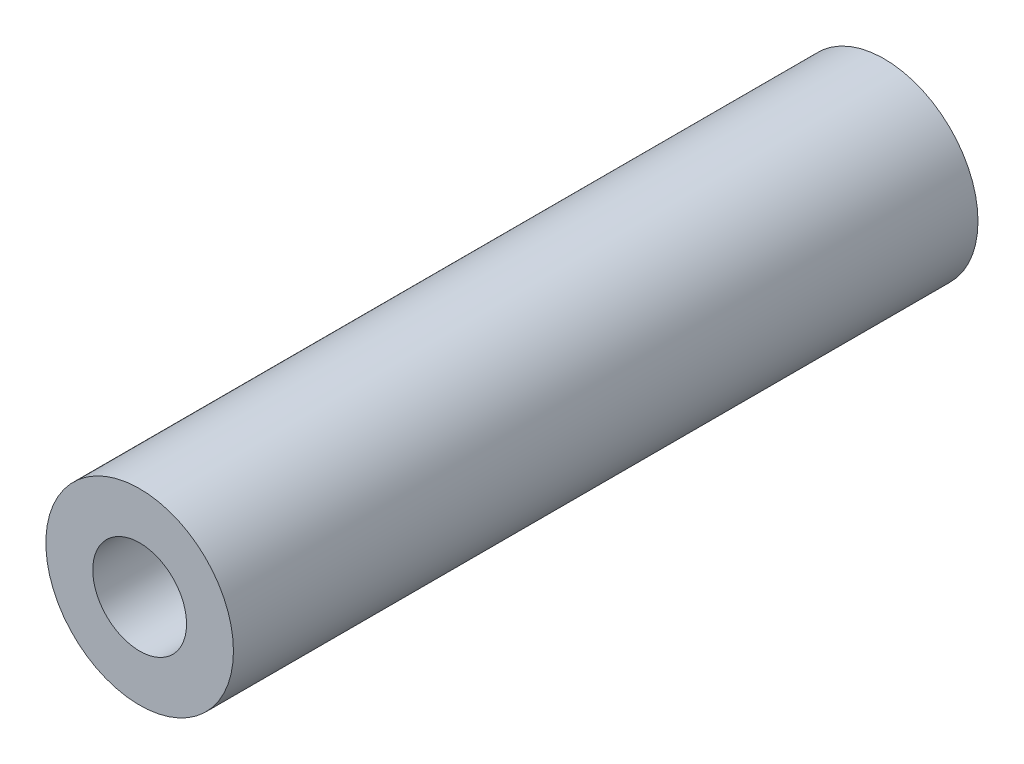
ISO-10303-21;
HEADER;
FILE_DESCRIPTION(('STEP AP214'),'2;1');
FILE_NAME('part.step','',(''),(''),'','','');
FILE_SCHEMA(('AUTOMOTIVE_DESIGN { 1 0 10303 214 1 1 1 1 }'));
ENDSEC;
DATA;
#1=APPLICATION_CONTEXT('core data for automotive mechanical design processes');
#2=APPLICATION_PROTOCOL_DEFINITION('international standard','automotive_design',2000,#1);
#3=PRODUCT_CONTEXT('',#1,'mechanical');
#4=PRODUCT('Part','Part','',(#3));
#5=PRODUCT_RELATED_PRODUCT_CATEGORY('part','',(#4));
#6=PRODUCT_DEFINITION_FORMATION('','',#4);
#7=PRODUCT_DEFINITION_CONTEXT('part definition',#1,'design');
#8=PRODUCT_DEFINITION('design','',#6,#7);
#9=PRODUCT_DEFINITION_SHAPE('','',#8);
#10=(LENGTH_UNIT() NAMED_UNIT(*) SI_UNIT(.MILLI.,.METRE.));
#11=(NAMED_UNIT(*) PLANE_ANGLE_UNIT() SI_UNIT($,.RADIAN.));
#12=(NAMED_UNIT(*) SI_UNIT($,.STERADIAN.) SOLID_ANGLE_UNIT());
#13=UNCERTAINTY_MEASURE_WITH_UNIT(LENGTH_MEASURE(1.E-05),#10,'distance_accuracy_value','');
#14=(GEOMETRIC_REPRESENTATION_CONTEXT(3) GLOBAL_UNCERTAINTY_ASSIGNED_CONTEXT((#13)) GLOBAL_UNIT_ASSIGNED_CONTEXT((#10,
#11,#12)) REPRESENTATION_CONTEXT('',''));
#15=CARTESIAN_POINT('',(0.,0.,0.));
#16=DIRECTION('',(0.,0.,1.));
#17=DIRECTION('',(1.,0.,0.));
#18=AXIS2_PLACEMENT_3D('',#15,#16,#17);
#19=CARTESIAN_POINT('',(0.,0.,127.));
#20=DIRECTION('',(0.,0.,1.));
#21=DIRECTION('',(1.,0.,0.));
#22=AXIS2_PLACEMENT_3D('',#19,#20,#21);
#23=PLANE('',#22);
#24=CARTESIAN_POINT('',(0.,0.,127.));
#25=DIRECTION('',(0.,0.,1.));
#26=DIRECTION('',(1.,0.,0.));
#27=AXIS2_PLACEMENT_3D('',#24,#25,#26);
#28=CIRCLE('',#27,16.);
#29=CARTESIAN_POINT('',(16.,0.,127.));
#30=VERTEX_POINT('',#29);
#31=EDGE_CURVE('E9',#30,#30,#28,.T.);
#32=ORIENTED_EDGE('',*,*,#31,.T.);
#33=EDGE_LOOP('',(#32));
#34=FACE_BOUND('',#33,.T.);
#35=CARTESIAN_POINT('',(0.,0.,127.));
#36=DIRECTION('',(0.,0.,1.));
#37=DIRECTION('',(1.,0.,0.));
#38=AXIS2_PLACEMENT_3D('',#35,#36,#37);
#39=CIRCLE('',#38,8.);
#40=CARTESIAN_POINT('',(8.,0.,127.));
#41=VERTEX_POINT('',#40);
#42=EDGE_CURVE('E25',#41,#41,#39,.T.);
#43=ORIENTED_EDGE('',*,*,#42,.F.);
#44=EDGE_LOOP('',(#43));
#45=FACE_BOUND('',#44,.T.);
#46=ADVANCED_FACE('F14',(#34,#45),#23,.T.);
#47=CARTESIAN_POINT('',(0.,0.,0.));
#48=DIRECTION('',(0.,0.,1.));
#49=DIRECTION('',(1.,0.,0.));
#50=AXIS2_PLACEMENT_3D('',#47,#48,#49);
#51=PLANE('',#50);
#52=CARTESIAN_POINT('',(0.,0.,0.));
#53=DIRECTION('',(0.,0.,1.));
#54=DIRECTION('',(1.,0.,0.));
#55=AXIS2_PLACEMENT_3D('',#52,#53,#54);
#56=CIRCLE('',#55,16.);
#57=CARTESIAN_POINT('',(16.,0.,0.));
#58=VERTEX_POINT('',#57);
#59=EDGE_CURVE('E18',#58,#58,#56,.T.);
#60=ORIENTED_EDGE('',*,*,#59,.F.);
#61=EDGE_LOOP('',(#60));
#62=FACE_BOUND('',#61,.T.);
#63=CARTESIAN_POINT('',(0.,0.,0.));
#64=DIRECTION('',(0.,0.,1.));
#65=DIRECTION('',(1.,0.,0.));
#66=AXIS2_PLACEMENT_3D('',#63,#64,#65);
#67=CIRCLE('',#66,8.);
#68=CARTESIAN_POINT('',(8.,0.,0.));
#69=VERTEX_POINT('',#68);
#70=EDGE_CURVE('E27',#69,#69,#67,.T.);
#71=ORIENTED_EDGE('',*,*,#70,.T.);
#72=EDGE_LOOP('',(#71));
#73=FACE_BOUND('',#72,.T.);
#74=ADVANCED_FACE('F37',(#62,#73),#51,.F.);
#75=CARTESIAN_POINT('',(0.,0.,127.));
#76=DIRECTION('',(0.,0.,-1.));
#77=DIRECTION('',(-1.,0.,0.));
#78=AXIS2_PLACEMENT_3D('',#75,#76,#77);
#79=CYLINDRICAL_SURFACE('',#78,16.);
#80=ORIENTED_EDGE('',*,*,#31,.F.);
#81=EDGE_LOOP('',(#80));
#82=FACE_BOUND('',#81,.T.);
#83=ORIENTED_EDGE('',*,*,#59,.T.);
#84=EDGE_LOOP('',(#83));
#85=FACE_BOUND('',#84,.T.);
#86=ADVANCED_FACE('F16',(#82,#85),#79,.T.);
#87=CARTESIAN_POINT('',(0.,0.,127.));
#88=DIRECTION('',(0.,0.,-1.));
#89=DIRECTION('',(-1.,0.,0.));
#90=AXIS2_PLACEMENT_3D('',#87,#88,#89);
#91=CYLINDRICAL_SURFACE('',#90,8.);
#92=ORIENTED_EDGE('',*,*,#42,.T.);
#93=EDGE_LOOP('',(#92));
#94=FACE_BOUND('',#93,.T.);
#95=ORIENTED_EDGE('',*,*,#70,.F.);
#96=EDGE_LOOP('',(#95));
#97=FACE_BOUND('',#96,.T.);
#98=ADVANCED_FACE('F33',(#94,#97),#91,.F.);
#99=CLOSED_SHELL('',(#46,#74,#86,#98));
#100=MANIFOLD_SOLID_BREP('B1',#99);
#101=ADVANCED_BREP_SHAPE_REPRESENTATION('',(#18,#100),#14);
#102=SHAPE_DEFINITION_REPRESENTATION(#9,#101);
ENDSEC;
END-ISO-10303-21;
